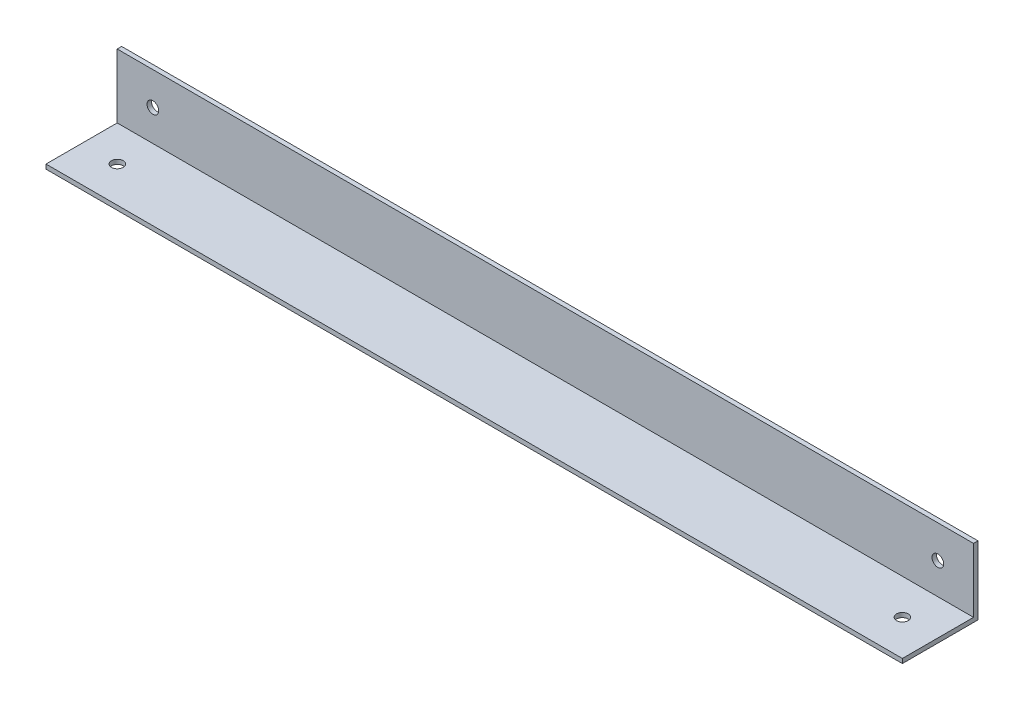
from build123d import *

# Parameters (mm, degrees)
SKETCH1_W           = 304.8
SKETCH1_H           = 24.384
BOSS_EXTRUDE1_DEPTH = 26.924
SKETCH2_W           = 304.8
SKETCH2_H           = 25.3365
CUT_EXTRUDE1_DEPTH  = 12.7
SKETCH3_W           = 304.8
SKETCH3_H           = 10.0965
CUT_EXTRUDE3_DEPTH  = 25.3365
SKETCH4_R           = 2.0828
CUT_EXTRUDE4_DEPTH  = 2.54
SKETCH5_R           = 2.0828
CUT_EXTRUDE5_DEPTH  = 2.54


with BuildPart() as part:
    # Sketch1 → Boss-Extrude1 (new body)
    with BuildSketch(Plane.XY):
        with Locations((-57.426086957, 55.646509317)):
            Rectangle(SKETCH1_W, SKETCH1_H)
    extrude(amount=BOSS_EXTRUDE1_DEPTH)

    # Sketch2 → Cut-Extrude1 (cut)
    with BuildSketch(Plane(origin=(0, 67.838509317, 0), x_dir=(1, 0, 0), z_dir=(0, 1, 0))):
        with Locations((-57.426086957, -14.25575)):
            Rectangle(SKETCH2_W, SKETCH2_H)
    extrude(amount=-CUT_EXTRUDE1_DEPTH, mode=Mode.SUBTRACT)

    # Sketch3 → Cut-Extrude3 (cut)
    with BuildSketch(Plane.XY.offset(26.924)):
        with Locations((-57.426086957, 50.090259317)):
            Rectangle(SKETCH3_W, SKETCH3_H)
    extrude(amount=-CUT_EXTRUDE3_DEPTH, mode=Mode.SUBTRACT)

    # Sketch4 → Cut-Extrude4 (cut)
    with BuildSketch(Plane(origin=(0, 0, 0), x_dir=(-1, 0, 0), z_dir=(0, 0, -1))):
        with Locations((-82.273913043, 56.154509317)):
            Circle(SKETCH4_R)
        with Locations((197.126086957, 56.154509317)):
            Circle(SKETCH4_R)
    extrude(amount=-CUT_EXTRUDE4_DEPTH, mode=Mode.SUBTRACT)

    # Sketch5 → Cut-Extrude5 (cut)
    with BuildSketch(Plane.XZ.offset(-43.454509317)):
        with Locations(Location((-197.126086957, 14.224, 0), (0, 0, 270))):
            Circle(SKETCH5_R)
        with Locations(Location((82.273913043, 14.224, 0), (0, 0, 270))):
            Circle(SKETCH5_R)
    extrude(amount=-CUT_EXTRUDE5_DEPTH, mode=Mode.SUBTRACT)


solid = part.part
